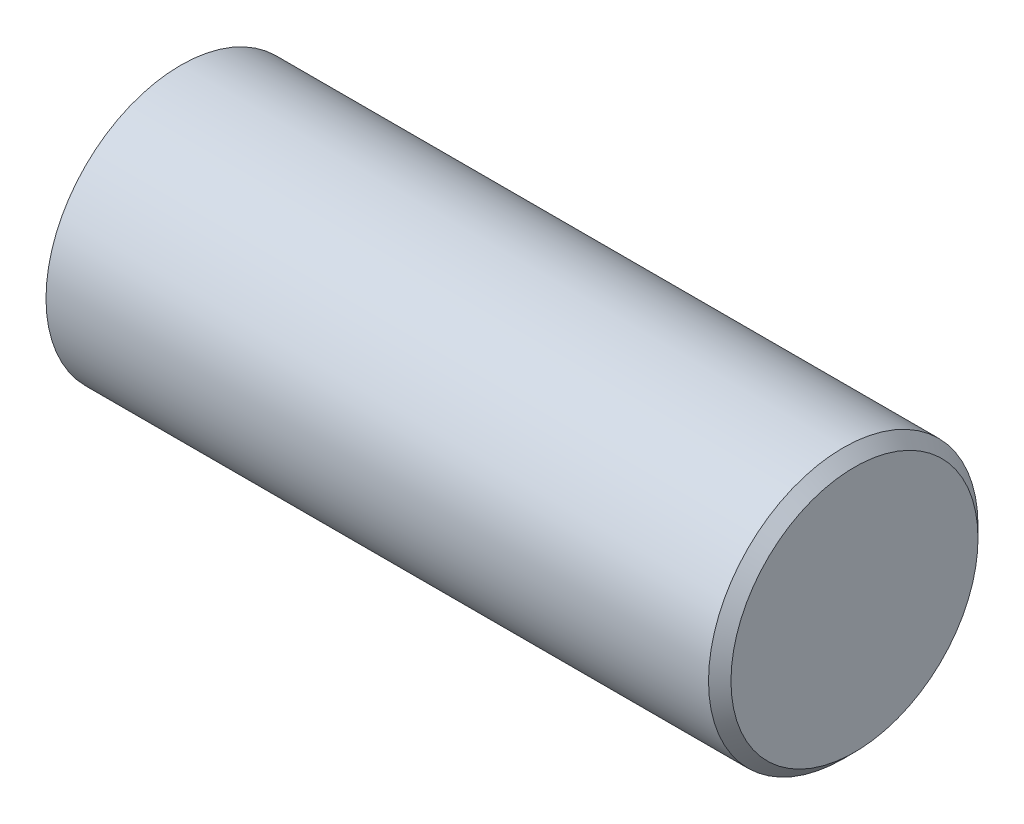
ISO-10303-21;
HEADER;
FILE_DESCRIPTION(('STEP AP214'),'2;1');
FILE_NAME('part.step','',(''),(''),'','','');
FILE_SCHEMA(('AUTOMOTIVE_DESIGN { 1 0 10303 214 1 1 1 1 }'));
ENDSEC;
DATA;
#1=APPLICATION_CONTEXT('core data for automotive mechanical design processes');
#2=APPLICATION_PROTOCOL_DEFINITION('international standard','automotive_design',2000,#1);
#3=PRODUCT_CONTEXT('',#1,'mechanical');
#4=PRODUCT('Part','Part','',(#3));
#5=PRODUCT_RELATED_PRODUCT_CATEGORY('part','',(#4));
#6=PRODUCT_DEFINITION_FORMATION('','',#4);
#7=PRODUCT_DEFINITION_CONTEXT('part definition',#1,'design');
#8=PRODUCT_DEFINITION('design','',#6,#7);
#9=PRODUCT_DEFINITION_SHAPE('','',#8);
#10=(LENGTH_UNIT() NAMED_UNIT(*) SI_UNIT(.MILLI.,.METRE.));
#11=(NAMED_UNIT(*) PLANE_ANGLE_UNIT() SI_UNIT($,.RADIAN.));
#12=(NAMED_UNIT(*) SI_UNIT($,.STERADIAN.) SOLID_ANGLE_UNIT());
#13=UNCERTAINTY_MEASURE_WITH_UNIT(LENGTH_MEASURE(1.E-05),#10,'distance_accuracy_value','');
#14=(GEOMETRIC_REPRESENTATION_CONTEXT(3) GLOBAL_UNCERTAINTY_ASSIGNED_CONTEXT((#13)) GLOBAL_UNIT_ASSIGNED_CONTEXT((#10,
#11,#12)) REPRESENTATION_CONTEXT('',''));
#15=CARTESIAN_POINT('',(0.,0.,0.));
#16=DIRECTION('',(0.,0.,1.));
#17=DIRECTION('',(1.,0.,0.));
#18=AXIS2_PLACEMENT_3D('',#15,#16,#17);
#19=CARTESIAN_POINT('',(10.,0.,0.));
#20=DIRECTION('',(-1.,0.,0.));
#21=DIRECTION('',(0.,1.,0.));
#22=AXIS2_PLACEMENT_3D('',#19,#20,#21);
#23=SPHERICAL_SURFACE('',#22,10.);
#24=CARTESIAN_POINT('',(2.,0.,0.));
#25=DIRECTION('',(-1.,0.,0.));
#26=DIRECTION('',(0.,0.,1.));
#27=AXIS2_PLACEMENT_3D('',#24,#25,#26);
#28=CIRCLE('',#27,6.);
#29=CARTESIAN_POINT('',(2.,0.,6.));
#30=VERTEX_POINT('',#29);
#31=EDGE_CURVE('E47',#30,#30,#28,.T.);
#32=ORIENTED_EDGE('',*,*,#31,.T.);
#33=EDGE_LOOP('',(#32));
#34=FACE_BOUND('',#33,.T.);
#35=ADVANCED_FACE('F36',(#34),#23,.T.);
#36=CARTESIAN_POINT('',(32.,0.,0.));
#37=DIRECTION('',(-1.,0.,0.));
#38=DIRECTION('',(0.,0.,1.));
#39=AXIS2_PLACEMENT_3D('',#36,#37,#38);
#40=PLANE('',#39);
#41=CARTESIAN_POINT('',(32.,0.,0.));
#42=DIRECTION('',(-1.,0.,0.));
#43=DIRECTION('',(0.,0.,1.));
#44=AXIS2_PLACEMENT_3D('',#41,#42,#43);
#45=CIRCLE('',#44,5.49999999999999);
#46=CARTESIAN_POINT('',(32.,0.,5.49999999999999));
#47=VERTEX_POINT('',#46);
#48=EDGE_CURVE('E10',#47,#47,#45,.F.);
#49=ORIENTED_EDGE('',*,*,#48,.T.);
#50=EDGE_LOOP('',(#49));
#51=FACE_BOUND('',#50,.T.);
#52=ADVANCED_FACE('F57',(#51),#40,.F.);
#53=CARTESIAN_POINT('',(0.,0.,0.));
#54=DIRECTION('',(-1.,0.,0.));
#55=DIRECTION('',(0.,0.,1.));
#56=AXIS2_PLACEMENT_3D('',#53,#54,#55);
#57=CYLINDRICAL_SURFACE('',#56,6.);
#58=CARTESIAN_POINT('',(31.5,0.,0.));
#59=DIRECTION('',(-1.,0.,0.));
#60=DIRECTION('',(0.,0.,1.));
#61=AXIS2_PLACEMENT_3D('',#58,#59,#60);
#62=CIRCLE('',#61,6.);
#63=CARTESIAN_POINT('',(31.5,0.,6.));
#64=VERTEX_POINT('',#63);
#65=EDGE_CURVE('E43',#64,#64,#62,.T.);
#66=ORIENTED_EDGE('',*,*,#65,.T.);
#67=EDGE_LOOP('',(#66));
#68=FACE_BOUND('',#67,.T.);
#69=ORIENTED_EDGE('',*,*,#31,.F.);
#70=EDGE_LOOP('',(#69));
#71=FACE_BOUND('',#70,.T.);
#72=ADVANCED_FACE('F55',(#68,#71),#57,.T.);
#73=CARTESIAN_POINT('',(31.5,0.,0.));
#74=DIRECTION('',(-1.,0.,0.));
#75=DIRECTION('',(0.,0.,1.));
#76=AXIS2_PLACEMENT_3D('',#73,#74,#75);
#77=CONICAL_SURFACE('',#76,6.,0.785398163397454);
#78=ORIENTED_EDGE('',*,*,#48,.F.);
#79=EDGE_LOOP('',(#78));
#80=FACE_BOUND('',#79,.T.);
#81=ORIENTED_EDGE('',*,*,#65,.F.);
#82=EDGE_LOOP('',(#81));
#83=FACE_BOUND('',#82,.T.);
#84=ADVANCED_FACE('F38',(#80,#83),#77,.T.);
#85=CLOSED_SHELL('',(#35,#52,#72,#84));
#86=MANIFOLD_SOLID_BREP('B2',#85);
#87=ADVANCED_BREP_SHAPE_REPRESENTATION('',(#18,#86),#14);
#88=SHAPE_DEFINITION_REPRESENTATION(#9,#87);
ENDSEC;
END-ISO-10303-21;
